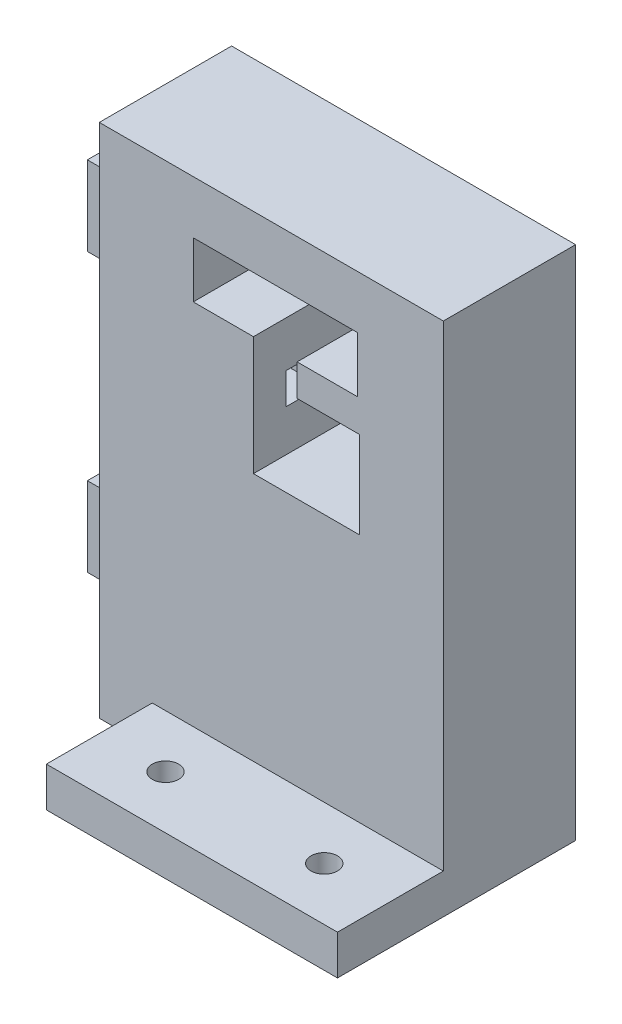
ISO-10303-21;
HEADER;
FILE_DESCRIPTION(('STEP AP214'),'2;1');
FILE_NAME('part.step','',(''),(''),'','','');
FILE_SCHEMA(('AUTOMOTIVE_DESIGN { 1 0 10303 214 1 1 1 1 }'));
ENDSEC;
DATA;
#1=APPLICATION_CONTEXT('core data for automotive mechanical design processes');
#2=APPLICATION_PROTOCOL_DEFINITION('international standard','automotive_design',2000,#1);
#3=PRODUCT_CONTEXT('',#1,'mechanical');
#4=PRODUCT('Part','Part','',(#3));
#5=PRODUCT_RELATED_PRODUCT_CATEGORY('part','',(#4));
#6=PRODUCT_DEFINITION_FORMATION('','',#4);
#7=PRODUCT_DEFINITION_CONTEXT('part definition',#1,'design');
#8=PRODUCT_DEFINITION('design','',#6,#7);
#9=PRODUCT_DEFINITION_SHAPE('','',#8);
#10=(LENGTH_UNIT() NAMED_UNIT(*) SI_UNIT(.MILLI.,.METRE.));
#11=(NAMED_UNIT(*) PLANE_ANGLE_UNIT() SI_UNIT($,.RADIAN.));
#12=(NAMED_UNIT(*) SI_UNIT($,.STERADIAN.) SOLID_ANGLE_UNIT());
#13=UNCERTAINTY_MEASURE_WITH_UNIT(LENGTH_MEASURE(1.E-05),#10,'distance_accuracy_value','');
#14=(GEOMETRIC_REPRESENTATION_CONTEXT(3) GLOBAL_UNCERTAINTY_ASSIGNED_CONTEXT((#13)) GLOBAL_UNIT_ASSIGNED_CONTEXT((#10,
#11,#12)) REPRESENTATION_CONTEXT('',''));
#15=CARTESIAN_POINT('',(0.,0.,0.));
#16=DIRECTION('',(0.,0.,1.));
#17=DIRECTION('',(1.,0.,0.));
#18=AXIS2_PLACEMENT_3D('',#15,#16,#17);
#19=CARTESIAN_POINT('',(100.,195.,-325.));
#20=DIRECTION('',(1.,0.,0.));
#21=DIRECTION('',(0.,0.,-1.));
#22=AXIS2_PLACEMENT_3D('',#19,#20,#21);
#23=PLANE('',#22);
#24=DIRECTION('',(0.,0.,1.));
#25=VECTOR('',#24,1.);
#26=CARTESIAN_POINT('',(100.,135.,0.));
#27=LINE('',#26,#25);
#28=CARTESIAN_POINT('',(100.,135.,-309.505907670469));
#29=VERTEX_POINT('',#28);
#30=CARTESIAN_POINT('',(100.,135.,-290.505907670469));
#31=VERTEX_POINT('',#30);
#32=EDGE_CURVE('E330',#29,#31,#27,.T.);
#33=ORIENTED_EDGE('',*,*,#32,.F.);
#34=DIRECTION('',(0.,1.,0.));
#35=VECTOR('',#34,1.);
#36=CARTESIAN_POINT('',(100.,0.,-309.505907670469));
#37=LINE('',#36,#35);
#38=CARTESIAN_POINT('',(100.,165.,-309.505907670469));
#39=VERTEX_POINT('',#38);
#40=EDGE_CURVE('E346',#29,#39,#37,.T.);
#41=ORIENTED_EDGE('',*,*,#40,.T.);
#42=DIRECTION('',(0.,0.,1.));
#43=VECTOR('',#42,1.);
#44=CARTESIAN_POINT('',(100.,165.,0.));
#45=LINE('',#44,#43);
#46=CARTESIAN_POINT('',(100.,165.,-290.505907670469));
#47=VERTEX_POINT('',#46);
#48=EDGE_CURVE('E80',#39,#47,#45,.T.);
#49=ORIENTED_EDGE('',*,*,#48,.T.);
#50=DIRECTION('',(0.,1.,0.));
#51=VECTOR('',#50,1.);
#52=CARTESIAN_POINT('',(100.,0.,-290.505907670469));
#53=LINE('',#52,#51);
#54=EDGE_CURVE('E335',#31,#47,#53,.T.);
#55=ORIENTED_EDGE('',*,*,#54,.F.);
#56=EDGE_LOOP('',(#33,#41,#49,#55));
#57=FACE_BOUND('',#56,.T.);
#58=DIRECTION('',(0.,0.,1.));
#59=VECTOR('',#58,1.);
#60=CARTESIAN_POINT('',(100.,195.,-325.));
#61=LINE('',#60,#59);
#62=CARTESIAN_POINT('',(100.,195.,-325.));
#63=VERTEX_POINT('',#62);
#64=CARTESIAN_POINT('',(100.,195.,-275.011815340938));
#65=VERTEX_POINT('',#64);
#66=EDGE_CURVE('E381',#63,#65,#61,.T.);
#67=ORIENTED_EDGE('',*,*,#66,.F.);
#68=DIRECTION('',(0.,1.,0.));
#69=VECTOR('',#68,1.);
#70=CARTESIAN_POINT('',(100.,195.,-325.));
#71=LINE('',#70,#69);
#72=CARTESIAN_POINT('',(100.,0.,-325.));
#73=VERTEX_POINT('',#72);
#74=EDGE_CURVE('E377',#73,#63,#71,.T.);
#75=ORIENTED_EDGE('',*,*,#74,.F.);
#76=DIRECTION('',(0.,0.,1.));
#77=VECTOR('',#76,1.);
#78=CARTESIAN_POINT('',(100.,0.,-325.));
#79=LINE('',#78,#77);
#80=CARTESIAN_POINT('',(100.,0.,-275.011815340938));
#81=VERTEX_POINT('',#80);
#82=EDGE_CURVE('E382',#73,#81,#79,.T.);
#83=ORIENTED_EDGE('',*,*,#82,.T.);
#84=DIRECTION('',(0.,-1.,0.));
#85=VECTOR('',#84,1.);
#86=CARTESIAN_POINT('',(100.,250.,-275.011815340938));
#87=LINE('',#86,#85);
#88=EDGE_CURVE('E385',#65,#81,#87,.T.);
#89=ORIENTED_EDGE('',*,*,#88,.F.);
#90=EDGE_LOOP('',(#67,#75,#83,#89));
#91=FACE_BOUND('',#90,.T.);
#92=DIRECTION('',(0.,0.,1.));
#93=VECTOR('',#92,1.);
#94=CARTESIAN_POINT('',(100.,30.,0.));
#95=LINE('',#94,#93);
#96=CARTESIAN_POINT('',(100.,30.,-309.505907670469));
#97=VERTEX_POINT('',#96);
#98=CARTESIAN_POINT('',(100.,30.,-290.505907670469));
#99=VERTEX_POINT('',#98);
#100=EDGE_CURVE('E327',#97,#99,#95,.T.);
#101=ORIENTED_EDGE('',*,*,#100,.F.);
#102=DIRECTION('',(0.,1.,0.));
#103=VECTOR('',#102,1.);
#104=CARTESIAN_POINT('',(100.,0.,-309.505907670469));
#105=LINE('',#104,#103);
#106=CARTESIAN_POINT('',(100.,60.,-309.505907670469));
#107=VERTEX_POINT('',#106);
#108=EDGE_CURVE('E323',#97,#107,#105,.T.);
#109=ORIENTED_EDGE('',*,*,#108,.T.);
#110=DIRECTION('',(0.,0.,1.));
#111=VECTOR('',#110,1.);
#112=CARTESIAN_POINT('',(100.,60.,0.));
#113=LINE('',#112,#111);
#114=CARTESIAN_POINT('',(100.,60.,-290.505907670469));
#115=VERTEX_POINT('',#114);
#116=EDGE_CURVE('E72',#107,#115,#113,.T.);
#117=ORIENTED_EDGE('',*,*,#116,.T.);
#118=DIRECTION('',(0.,1.,0.));
#119=VECTOR('',#118,1.);
#120=CARTESIAN_POINT('',(100.,0.,-290.505907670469));
#121=LINE('',#120,#119);
#122=EDGE_CURVE('E1366',#99,#115,#121,.T.);
#123=ORIENTED_EDGE('',*,*,#122,.F.);
#124=EDGE_LOOP('',(#101,#109,#117,#123));
#125=FACE_BOUND('',#124,.T.);
#126=ADVANCED_FACE('F56',(#57,#91,#125),#23,.F.);
#127=CARTESIAN_POINT('',(230.,250.,-275.011815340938));
#128=DIRECTION('',(0.,0.,-1.));
#129=DIRECTION('',(-1.,0.,0.));
#130=AXIS2_PLACEMENT_3D('',#127,#128,#129);
#131=PLANE('',#130);
#132=DIRECTION('',(0.,1.,0.));
#133=VECTOR('',#132,1.);
#134=CARTESIAN_POINT('',(174.75,154.,-275.011815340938));
#135=LINE('',#134,#133);
#136=CARTESIAN_POINT('',(174.75,142.02964265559,-275.011815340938));
#137=VERTEX_POINT('',#136);
#138=CARTESIAN_POINT('',(174.75,154.,-275.011815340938));
#139=VERTEX_POINT('',#138);
#140=EDGE_CURVE('E683',#137,#139,#135,.T.);
#141=ORIENTED_EDGE('',*,*,#140,.F.);
#142=DIRECTION('',(-1.,0.,0.));
#143=VECTOR('',#142,1.);
#144=CARTESIAN_POINT('',(158.25,142.02964265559,-275.011815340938));
#145=LINE('',#144,#143);
#146=CARTESIAN_POINT('',(198.25,142.02964265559,-275.011815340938));
#147=VERTEX_POINT('',#146);
#148=EDGE_CURVE('E456',#147,#137,#145,.T.);
#149=ORIENTED_EDGE('',*,*,#148,.F.);
#150=DIRECTION('',(0.,1.,0.));
#151=VECTOR('',#150,1.);
#152=CARTESIAN_POINT('',(198.25,142.02964265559,-275.011815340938));
#153=LINE('',#152,#151);
#154=CARTESIAN_POINT('',(198.25,109.17533799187,-275.011815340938));
#155=VERTEX_POINT('',#154);
#156=EDGE_CURVE('E1416',#155,#147,#153,.T.);
#157=ORIENTED_EDGE('',*,*,#156,.F.);
#158=DIRECTION('',(1.,0.,0.));
#159=VECTOR('',#158,1.);
#160=CARTESIAN_POINT('',(198.25,109.17533799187,-275.011815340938));
#161=LINE('',#160,#159);
#162=CARTESIAN_POINT('',(158.25,109.17533799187,-275.011815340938));
#163=VERTEX_POINT('',#162);
#164=EDGE_CURVE('E1412',#163,#155,#161,.T.);
#165=ORIENTED_EDGE('',*,*,#164,.F.);
#166=DIRECTION('',(0.,-1.,0.));
#167=VECTOR('',#166,1.);
#168=CARTESIAN_POINT('',(158.25,154.,-275.011815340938));
#169=LINE('',#168,#167);
#170=CARTESIAN_POINT('',(158.25,154.,-275.011815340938));
#171=VERTEX_POINT('',#170);
#172=EDGE_CURVE('E672',#171,#163,#169,.T.);
#173=ORIENTED_EDGE('',*,*,#172,.F.);
#174=DIRECTION('',(-1.,0.,0.));
#175=VECTOR('',#174,1.);
#176=CARTESIAN_POINT('',(230.,154.,-275.011815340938));
#177=LINE('',#176,#175);
#178=CARTESIAN_POINT('',(135.5,154.,-275.011815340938));
#179=VERTEX_POINT('',#178);
#180=EDGE_CURVE('E599',#171,#179,#177,.T.);
#181=ORIENTED_EDGE('',*,*,#180,.T.);
#182=DIRECTION('',(0.,1.,0.));
#183=VECTOR('',#182,1.);
#184=CARTESIAN_POINT('',(135.5,250.,-275.011815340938));
#185=LINE('',#184,#183);
#186=CARTESIAN_POINT('',(135.5,175.,-275.011815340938));
#187=VERTEX_POINT('',#186);
#188=EDGE_CURVE('E604',#179,#187,#185,.T.);
#189=ORIENTED_EDGE('',*,*,#188,.T.);
#190=DIRECTION('',(1.,0.,0.));
#191=VECTOR('',#190,1.);
#192=CARTESIAN_POINT('',(230.,175.,-275.011815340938));
#193=LINE('',#192,#191);
#194=CARTESIAN_POINT('',(197.5,175.,-275.011815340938));
#195=VERTEX_POINT('',#194);
#196=EDGE_CURVE('E585',#187,#195,#193,.T.);
#197=ORIENTED_EDGE('',*,*,#196,.T.);
#198=DIRECTION('',(0.,-1.,0.));
#199=VECTOR('',#198,1.);
#200=CARTESIAN_POINT('',(197.5,250.,-275.011815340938));
#201=LINE('',#200,#199);
#202=CARTESIAN_POINT('',(197.5,154.,-275.011815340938));
#203=VERTEX_POINT('',#202);
#204=EDGE_CURVE('E595',#195,#203,#201,.T.);
#205=ORIENTED_EDGE('',*,*,#204,.T.);
#206=EDGE_CURVE('E600',#203,#139,#177,.T.);
#207=ORIENTED_EDGE('',*,*,#206,.T.);
#208=EDGE_LOOP('',(#141,#149,#157,#165,#173,#181,#189,#197,#205,#207));
#209=FACE_BOUND('',#208,.T.);
#210=DIRECTION('',(1.,0.,0.));
#211=VECTOR('',#210,1.);
#212=CARTESIAN_POINT('',(230.,195.,-275.011815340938));
#213=LINE('',#212,#211);
#214=CARTESIAN_POINT('',(230.,195.,-275.011815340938));
#215=VERTEX_POINT('',#214);
#216=EDGE_CURVE('E700',#65,#215,#213,.T.);
#217=ORIENTED_EDGE('',*,*,#216,.F.);
#218=ORIENTED_EDGE('',*,*,#88,.T.);
#219=DIRECTION('',(-1.,0.,0.));
#220=VECTOR('',#219,1.);
#221=CARTESIAN_POINT('',(230.,0.,-275.011815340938));
#222=LINE('',#221,#220);
#223=CARTESIAN_POINT('',(120.,0.,-275.011815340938));
#224=VERTEX_POINT('',#223);
#225=EDGE_CURVE('E575',#224,#81,#222,.T.);
#226=ORIENTED_EDGE('',*,*,#225,.F.);
#227=DIRECTION('',(0.,-1.,0.));
#228=VECTOR('',#227,1.);
#229=CARTESIAN_POINT('',(120.,0.,-275.011815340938));
#230=LINE('',#229,#228);
#231=CARTESIAN_POINT('',(120.,15.,-275.011815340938));
#232=VERTEX_POINT('',#231);
#233=EDGE_CURVE('E414',#232,#224,#230,.T.);
#234=ORIENTED_EDGE('',*,*,#233,.F.);
#235=DIRECTION('',(-1.,0.,0.));
#236=VECTOR('',#235,1.);
#237=CARTESIAN_POINT('',(0.,15.,-275.011815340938));
#238=LINE('',#237,#236);
#239=CARTESIAN_POINT('',(230.,15.,-275.011815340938));
#240=VERTEX_POINT('',#239);
#241=EDGE_CURVE('E397',#240,#232,#238,.T.);
#242=ORIENTED_EDGE('',*,*,#241,.F.);
#243=DIRECTION('',(0.,-1.,0.));
#244=VECTOR('',#243,1.);
#245=CARTESIAN_POINT('',(230.,250.,-275.011815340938));
#246=LINE('',#245,#244);
#247=EDGE_CURVE('E588',#215,#240,#246,.T.);
#248=ORIENTED_EDGE('',*,*,#247,.F.);
#249=EDGE_LOOP('',(#217,#218,#226,#234,#242,#248));
#250=FACE_BOUND('',#249,.T.);
#251=ADVANCED_FACE('F522',(#209,#250),#131,.F.);
#252=CARTESIAN_POINT('',(197.5,154.,1.66533453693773E-13));
#253=DIRECTION('',(0.,-1.,0.));
#254=DIRECTION('',(0.,0.,-1.));
#255=AXIS2_PLACEMENT_3D('',#252,#253,#254);
#256=PLANE('',#255);
#257=DIRECTION('',(-1.,0.,0.));
#258=VECTOR('',#257,1.);
#259=CARTESIAN_POINT('',(197.5,154.,-325.));
#260=LINE('',#259,#258);
#261=CARTESIAN_POINT('',(197.5,154.,-325.));
#262=VERTEX_POINT('',#261);
#263=CARTESIAN_POINT('',(174.75,154.,-325.));
#264=VERTEX_POINT('',#263);
#265=EDGE_CURVE('E722',#262,#264,#260,.T.);
#266=ORIENTED_EDGE('',*,*,#265,.T.);
#267=DIRECTION('',(0.,0.,1.));
#268=VECTOR('',#267,1.);
#269=CARTESIAN_POINT('',(174.75,154.,-325.011815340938));
#270=LINE('',#269,#268);
#271=EDGE_CURVE('E687',#264,#139,#270,.T.);
#272=ORIENTED_EDGE('',*,*,#271,.T.);
#273=ORIENTED_EDGE('',*,*,#206,.F.);
#274=DIRECTION('',(0.,0.,-1.));
#275=VECTOR('',#274,1.);
#276=CARTESIAN_POINT('',(197.5,154.,1.66533453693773E-13));
#277=LINE('',#276,#275);
#278=EDGE_CURVE('E732',#203,#262,#277,.T.);
#279=ORIENTED_EDGE('',*,*,#278,.T.);
#280=EDGE_LOOP('',(#266,#272,#273,#279));
#281=FACE_BOUND('',#280,.T.);
#282=ADVANCED_FACE('F528',(#281),#256,.F.);
#283=CARTESIAN_POINT('',(0.,0.,0.));
#284=DIRECTION('',(0.,-1.,0.));
#285=DIRECTION('',(0.,0.,-1.));
#286=AXIS2_PLACEMENT_3D('',#283,#284,#285);
#287=PLANE('',#286);
#288=ORIENTED_EDGE('',*,*,#82,.F.);
#289=DIRECTION('',(-1.,0.,0.));
#290=VECTOR('',#289,1.);
#291=CARTESIAN_POINT('',(101.037708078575,0.,-325.));
#292=LINE('',#291,#290);
#293=CARTESIAN_POINT('',(230.,0.,-325.));
#294=VERTEX_POINT('',#293);
#295=EDGE_CURVE('E579',#294,#73,#292,.T.);
#296=ORIENTED_EDGE('',*,*,#295,.F.);
#297=DIRECTION('',(0.,0.,-1.));
#298=VECTOR('',#297,1.);
#299=CARTESIAN_POINT('',(230.,0.,-275.011815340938));
#300=LINE('',#299,#298);
#301=CARTESIAN_POINT('',(230.,0.,-235.011815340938));
#302=VERTEX_POINT('',#301);
#303=EDGE_CURVE('E580',#302,#294,#300,.T.);
#304=ORIENTED_EDGE('',*,*,#303,.F.);
#305=DIRECTION('',(1.,0.,0.));
#306=VECTOR('',#305,1.);
#307=CARTESIAN_POINT('',(0.,0.,-235.011815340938));
#308=LINE('',#307,#306);
#309=CARTESIAN_POINT('',(120.,0.,-235.011815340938));
#310=VERTEX_POINT('',#309);
#311=EDGE_CURVE('E420',#310,#302,#308,.T.);
#312=ORIENTED_EDGE('',*,*,#311,.F.);
#313=DIRECTION('',(0.,0.,-1.));
#314=VECTOR('',#313,1.);
#315=CARTESIAN_POINT('',(120.,0.,-235.011815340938));
#316=LINE('',#315,#314);
#317=EDGE_CURVE('E424',#310,#224,#316,.T.);
#318=ORIENTED_EDGE('',*,*,#317,.T.);
#319=ORIENTED_EDGE('',*,*,#225,.T.);
#320=EDGE_LOOP('',(#288,#296,#304,#312,#318,#319));
#321=FACE_BOUND('',#320,.T.);
#322=CARTESIAN_POINT('',(145.,0.,-255.011815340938));
#323=DIRECTION('',(0.,1.,0.));
#324=DIRECTION('',(-1.,0.,0.));
#325=AXIS2_PLACEMENT_3D('',#322,#323,#324);
#326=CIRCLE('',#325,5.00000000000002);
#327=CARTESIAN_POINT('',(140.,0.,-255.011815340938));
#328=VERTEX_POINT('',#327);
#329=EDGE_CURVE('E393',#328,#328,#326,.T.);
#330=ORIENTED_EDGE('',*,*,#329,.T.);
#331=EDGE_LOOP('',(#330));
#332=FACE_BOUND('',#331,.T.);
#333=CARTESIAN_POINT('',(205.,0.,-255.011815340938));
#334=DIRECTION('',(0.,1.,0.));
#335=DIRECTION('',(-1.,0.,0.));
#336=AXIS2_PLACEMENT_3D('',#333,#334,#335);
#337=CIRCLE('',#336,5.00000000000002);
#338=CARTESIAN_POINT('',(200.,0.,-255.011815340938));
#339=VERTEX_POINT('',#338);
#340=EDGE_CURVE('E392',#339,#339,#337,.T.);
#341=ORIENTED_EDGE('',*,*,#340,.T.);
#342=EDGE_LOOP('',(#341));
#343=FACE_BOUND('',#342,.T.);
#344=ADVANCED_FACE('F58',(#321,#332,#343),#287,.T.);
#345=CARTESIAN_POINT('',(230.,0.,0.));
#346=DIRECTION('',(1.,0.,0.));
#347=DIRECTION('',(0.,0.,-1.));
#348=AXIS2_PLACEMENT_3D('',#345,#346,#347);
#349=PLANE('',#348);
#350=DIRECTION('',(0.,0.,-1.));
#351=VECTOR('',#350,1.);
#352=CARTESIAN_POINT('',(230.,195.,-325.));
#353=LINE('',#352,#351);
#354=CARTESIAN_POINT('',(230.,195.,-325.));
#355=VERTEX_POINT('',#354);
#356=EDGE_CURVE('E703',#215,#355,#353,.T.);
#357=ORIENTED_EDGE('',*,*,#356,.F.);
#358=ORIENTED_EDGE('',*,*,#247,.T.);
#359=DIRECTION('',(0.,0.,-1.));
#360=VECTOR('',#359,1.);
#361=CARTESIAN_POINT('',(230.,15.,-235.011815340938));
#362=LINE('',#361,#360);
#363=CARTESIAN_POINT('',(230.,15.,-235.011815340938));
#364=VERTEX_POINT('',#363);
#365=EDGE_CURVE('E436',#364,#240,#362,.T.);
#366=ORIENTED_EDGE('',*,*,#365,.F.);
#367=DIRECTION('',(0.,1.,0.));
#368=VECTOR('',#367,1.);
#369=CARTESIAN_POINT('',(230.,0.,-235.011815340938));
#370=LINE('',#369,#368);
#371=EDGE_CURVE('E409',#302,#364,#370,.T.);
#372=ORIENTED_EDGE('',*,*,#371,.F.);
#373=ORIENTED_EDGE('',*,*,#303,.T.);
#374=DIRECTION('',(0.,1.,0.));
#375=VECTOR('',#374,1.);
#376=CARTESIAN_POINT('',(230.,0.,-325.));
#377=LINE('',#376,#375);
#378=EDGE_CURVE('E731',#294,#355,#377,.T.);
#379=ORIENTED_EDGE('',*,*,#378,.T.);
#380=EDGE_LOOP('',(#357,#358,#366,#372,#373,#379));
#381=FACE_BOUND('',#380,.T.);
#382=ADVANCED_FACE('F746',(#381),#349,.T.);
#383=CARTESIAN_POINT('',(197.5,175.,1.66533453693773E-13));
#384=DIRECTION('',(1.,0.,0.));
#385=DIRECTION('',(0.,0.,-1.));
#386=AXIS2_PLACEMENT_3D('',#383,#384,#385);
#387=PLANE('',#386);
#388=DIRECTION('',(0.,0.,-1.));
#389=VECTOR('',#388,1.);
#390=CARTESIAN_POINT('',(197.5,175.,1.66533453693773E-13));
#391=LINE('',#390,#389);
#392=CARTESIAN_POINT('',(197.5,175.,-325.));
#393=VERTEX_POINT('',#392);
#394=EDGE_CURVE('E735',#195,#393,#391,.T.);
#395=ORIENTED_EDGE('',*,*,#394,.T.);
#396=DIRECTION('',(0.,-1.,0.));
#397=VECTOR('',#396,1.);
#398=CARTESIAN_POINT('',(197.5,175.,-325.));
#399=LINE('',#398,#397);
#400=EDGE_CURVE('E717',#393,#262,#399,.T.);
#401=ORIENTED_EDGE('',*,*,#400,.T.);
#402=ORIENTED_EDGE('',*,*,#278,.F.);
#403=ORIENTED_EDGE('',*,*,#204,.F.);
#404=EDGE_LOOP('',(#395,#401,#402,#403));
#405=FACE_BOUND('',#404,.T.);
#406=ADVANCED_FACE('F768',(#405),#387,.F.);
#407=CARTESIAN_POINT('',(166.5,175.,1.66533453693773E-13));
#408=DIRECTION('',(0.,1.,0.));
#409=DIRECTION('',(0.,0.,1.));
#410=AXIS2_PLACEMENT_3D('',#407,#408,#409);
#411=PLANE('',#410);
#412=DIRECTION('',(0.,0.,-1.));
#413=VECTOR('',#412,1.);
#414=CARTESIAN_POINT('',(135.5,175.,1.11022302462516E-13));
#415=LINE('',#414,#413);
#416=CARTESIAN_POINT('',(135.5,175.,-325.));
#417=VERTEX_POINT('',#416);
#418=EDGE_CURVE('E726',#187,#417,#415,.T.);
#419=ORIENTED_EDGE('',*,*,#418,.T.);
#420=DIRECTION('',(1.,0.,0.));
#421=VECTOR('',#420,1.);
#422=CARTESIAN_POINT('',(166.5,175.,-325.));
#423=LINE('',#422,#421);
#424=EDGE_CURVE('E713',#417,#393,#423,.T.);
#425=ORIENTED_EDGE('',*,*,#424,.T.);
#426=ORIENTED_EDGE('',*,*,#394,.F.);
#427=ORIENTED_EDGE('',*,*,#196,.F.);
#428=EDGE_LOOP('',(#419,#425,#426,#427));
#429=FACE_BOUND('',#428,.T.);
#430=ADVANCED_FACE('F784',(#429),#411,.F.);
#431=CARTESIAN_POINT('',(135.5,154.,1.11022302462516E-13));
#432=DIRECTION('',(-1.,0.,0.));
#433=DIRECTION('',(0.,0.,1.));
#434=AXIS2_PLACEMENT_3D('',#431,#432,#433);
#435=PLANE('',#434);
#436=DIRECTION('',(0.,0.,-1.));
#437=VECTOR('',#436,1.);
#438=CARTESIAN_POINT('',(135.5,154.,1.11022302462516E-13));
#439=LINE('',#438,#437);
#440=CARTESIAN_POINT('',(135.5,154.,-325.));
#441=VERTEX_POINT('',#440);
#442=EDGE_CURVE('E727',#179,#441,#439,.T.);
#443=ORIENTED_EDGE('',*,*,#442,.T.);
#444=DIRECTION('',(0.,1.,0.));
#445=VECTOR('',#444,1.);
#446=CARTESIAN_POINT('',(135.5,154.,-325.));
#447=LINE('',#446,#445);
#448=EDGE_CURVE('E710',#441,#417,#447,.T.);
#449=ORIENTED_EDGE('',*,*,#448,.T.);
#450=ORIENTED_EDGE('',*,*,#418,.F.);
#451=ORIENTED_EDGE('',*,*,#188,.F.);
#452=EDGE_LOOP('',(#443,#449,#450,#451));
#453=FACE_BOUND('',#452,.T.);
#454=ADVANCED_FACE('F778',(#453),#435,.F.);
#455=ORIENTED_EDGE('',*,*,#180,.F.);
#456=DIRECTION('',(0.,0.,1.));
#457=VECTOR('',#456,1.);
#458=CARTESIAN_POINT('',(158.25,154.,-325.011815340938));
#459=LINE('',#458,#457);
#460=CARTESIAN_POINT('',(158.25,154.,-325.));
#461=VERTEX_POINT('',#460);
#462=EDGE_CURVE('E686',#461,#171,#459,.T.);
#463=ORIENTED_EDGE('',*,*,#462,.F.);
#464=EDGE_CURVE('E721',#461,#441,#260,.T.);
#465=ORIENTED_EDGE('',*,*,#464,.T.);
#466=ORIENTED_EDGE('',*,*,#442,.F.);
#467=EDGE_LOOP('',(#455,#463,#465,#466));
#468=FACE_BOUND('',#467,.T.);
#469=ADVANCED_FACE('F772',(#468),#256,.F.);
#470=CARTESIAN_POINT('',(101.037708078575,71.6208477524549,-325.));
#471=DIRECTION('',(0.,0.,-1.));
#472=DIRECTION('',(-1.,0.,0.));
#473=AXIS2_PLACEMENT_3D('',#470,#471,#472);
#474=PLANE('',#473);
#475=ORIENTED_EDGE('',*,*,#74,.T.);
#476=DIRECTION('',(-1.,0.,0.));
#477=VECTOR('',#476,1.);
#478=CARTESIAN_POINT('',(30.,195.,-325.));
#479=LINE('',#478,#477);
#480=EDGE_CURVE('E706',#355,#63,#479,.T.);
#481=ORIENTED_EDGE('',*,*,#480,.F.);
#482=ORIENTED_EDGE('',*,*,#378,.F.);
#483=ORIENTED_EDGE('',*,*,#295,.T.);
#484=EDGE_LOOP('',(#475,#481,#482,#483));
#485=FACE_BOUND('',#484,.T.);
#486=CARTESIAN_POINT('',(131.61635674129,129.990231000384,-325.));
#487=DIRECTION('',(0.,0.,-1.));
#488=DIRECTION('',(-1.,0.,0.));
#489=AXIS2_PLACEMENT_3D('',#486,#487,#488);
#490=CIRCLE('',#489,3.49999999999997);
#491=CARTESIAN_POINT('',(128.11635674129,129.990231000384,-325.));
#492=VERTEX_POINT('',#491);
#493=EDGE_CURVE('E439',#492,#492,#490,.T.);
#494=ORIENTED_EDGE('',*,*,#493,.F.);
#495=EDGE_LOOP('',(#494));
#496=FACE_BOUND('',#495,.T.);
#497=DIRECTION('',(1.,0.,0.));
#498=VECTOR('',#497,1.);
#499=CARTESIAN_POINT('',(101.037708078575,142.02964265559,-325.));
#500=LINE('',#499,#498);
#501=CARTESIAN_POINT('',(174.75,142.02964265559,-325.));
#502=VERTEX_POINT('',#501);
#503=CARTESIAN_POINT('',(198.25,142.02964265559,-325.));
#504=VERTEX_POINT('',#503);
#505=EDGE_CURVE('E813',#502,#504,#500,.T.);
#506=ORIENTED_EDGE('',*,*,#505,.F.);
#507=DIRECTION('',(0.,-1.,0.));
#508=VECTOR('',#507,1.);
#509=CARTESIAN_POINT('',(174.75,71.620847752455,-325.));
#510=LINE('',#509,#508);
#511=EDGE_CURVE('E696',#264,#502,#510,.T.);
#512=ORIENTED_EDGE('',*,*,#511,.F.);
#513=ORIENTED_EDGE('',*,*,#265,.F.);
#514=ORIENTED_EDGE('',*,*,#400,.F.);
#515=ORIENTED_EDGE('',*,*,#424,.F.);
#516=ORIENTED_EDGE('',*,*,#448,.F.);
#517=ORIENTED_EDGE('',*,*,#464,.F.);
#518=DIRECTION('',(0.,1.,0.));
#519=VECTOR('',#518,1.);
#520=CARTESIAN_POINT('',(158.25,71.620847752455,-325.));
#521=LINE('',#520,#519);
#522=CARTESIAN_POINT('',(158.25,109.17533799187,-325.));
#523=VERTEX_POINT('',#522);
#524=EDGE_CURVE('E691',#523,#461,#521,.T.);
#525=ORIENTED_EDGE('',*,*,#524,.F.);
#526=DIRECTION('',(-1.,0.,0.));
#527=VECTOR('',#526,1.);
#528=CARTESIAN_POINT('',(101.037708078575,109.17533799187,-325.));
#529=LINE('',#528,#527);
#530=CARTESIAN_POINT('',(198.25,109.17533799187,-325.));
#531=VERTEX_POINT('',#530);
#532=EDGE_CURVE('E818',#531,#523,#529,.T.);
#533=ORIENTED_EDGE('',*,*,#532,.F.);
#534=DIRECTION('',(0.,-1.,0.));
#535=VECTOR('',#534,1.);
#536=CARTESIAN_POINT('',(198.25,71.6208477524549,-325.));
#537=LINE('',#536,#535);
#538=EDGE_CURVE('E815',#504,#531,#537,.T.);
#539=ORIENTED_EDGE('',*,*,#538,.F.);
#540=EDGE_LOOP('',(#506,#512,#513,#514,#515,#516,#517,#525,#533,#539));
#541=FACE_BOUND('',#540,.T.);
#542=ADVANCED_FACE('F753',(#485,#496,#541),#474,.T.);
#543=CARTESIAN_POINT('',(0.,195.,0.));
#544=DIRECTION('',(0.,-1.,0.));
#545=DIRECTION('',(0.,0.,-1.));
#546=AXIS2_PLACEMENT_3D('',#543,#544,#545);
#547=PLANE('',#546);
#548=ORIENTED_EDGE('',*,*,#480,.T.);
#549=ORIENTED_EDGE('',*,*,#66,.T.);
#550=ORIENTED_EDGE('',*,*,#216,.T.);
#551=ORIENTED_EDGE('',*,*,#356,.T.);
#552=EDGE_LOOP('',(#548,#549,#550,#551));
#553=FACE_BOUND('',#552,.T.);
#554=ADVANCED_FACE('F749',(#553),#547,.F.);
#555=CARTESIAN_POINT('',(174.75,154.,-325.011815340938));
#556=DIRECTION('',(1.,0.,0.));
#557=DIRECTION('',(0.,1.,0.));
#558=AXIS2_PLACEMENT_3D('',#555,#556,#557);
#559=PLANE('',#558);
#560=ORIENTED_EDGE('',*,*,#511,.T.);
#561=DIRECTION('',(0.,0.,1.));
#562=VECTOR('',#561,1.);
#563=CARTESIAN_POINT('',(174.75,142.02964265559,-325.011815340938));
#564=LINE('',#563,#562);
#565=EDGE_CURVE('E819',#502,#137,#564,.T.);
#566=ORIENTED_EDGE('',*,*,#565,.T.);
#567=ORIENTED_EDGE('',*,*,#140,.T.);
#568=ORIENTED_EDGE('',*,*,#271,.F.);
#569=EDGE_LOOP('',(#560,#566,#567,#568));
#570=FACE_BOUND('',#569,.T.);
#571=ADVANCED_FACE('F810',(#570),#559,.F.);
#572=CARTESIAN_POINT('',(158.25,154.,-325.011815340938));
#573=DIRECTION('',(-1.,0.,0.));
#574=DIRECTION('',(0.,-1.,0.));
#575=AXIS2_PLACEMENT_3D('',#572,#573,#574);
#576=PLANE('',#575);
#577=ORIENTED_EDGE('',*,*,#172,.T.);
#578=DIRECTION('',(0.,0.,1.));
#579=VECTOR('',#578,1.);
#580=CARTESIAN_POINT('',(158.25,109.17533799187,-325.011815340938));
#581=LINE('',#580,#579);
#582=EDGE_CURVE('E1409',#523,#163,#581,.T.);
#583=ORIENTED_EDGE('',*,*,#582,.F.);
#584=ORIENTED_EDGE('',*,*,#524,.T.);
#585=ORIENTED_EDGE('',*,*,#462,.T.);
#586=EDGE_LOOP('',(#577,#583,#584,#585));
#587=FACE_BOUND('',#586,.T.);
#588=DIRECTION('',(0.,0.,1.));
#589=VECTOR('',#588,1.);
#590=CARTESIAN_POINT('',(158.25,136.72325264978,-287.320111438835));
#591=LINE('',#590,#589);
#592=CARTESIAN_POINT('',(158.25,136.72325264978,-300.820111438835));
#593=VERTEX_POINT('',#592);
#594=CARTESIAN_POINT('',(158.25,136.72325264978,-287.320111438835));
#595=VERTEX_POINT('',#594);
#596=EDGE_CURVE('E837',#593,#595,#591,.T.);
#597=ORIENTED_EDGE('',*,*,#596,.F.);
#598=DIRECTION('',(0.,1.,0.));
#599=VECTOR('',#598,1.);
#600=CARTESIAN_POINT('',(158.25,136.72325264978,-300.820111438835));
#601=LINE('',#600,#599);
#602=CARTESIAN_POINT('',(158.25,132.848593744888,-300.820111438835));
#603=VERTEX_POINT('',#602);
#604=EDGE_CURVE('E871',#603,#593,#601,.T.);
#605=ORIENTED_EDGE('',*,*,#604,.F.);
#606=CARTESIAN_POINT('',(158.25,125.100374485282,-298.75115225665));
#607=CARTESIAN_POINT('',(158.25,129.957776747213,-304.296229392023));
#608=CARTESIAN_POINT('',(158.25,135.600374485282,-298.75115225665));
#609=B_SPLINE_CURVE_WITH_KNOTS('',2,(#606,#607,#608),.UNSPECIFIED.,.F.,.F.,(3,3),(0.,1.),.UNSPECIFIED.);
#610=CARTESIAN_POINT('',(158.25,127.559185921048,-300.820111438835));
#611=VERTEX_POINT('',#610);
#612=EDGE_CURVE('E658',#611,#603,#609,.T.);
#613=ORIENTED_EDGE('',*,*,#612,.F.);
#614=CARTESIAN_POINT('',(158.25,124.92325264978,-300.820111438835));
#615=VERTEX_POINT('',#614);
#616=EDGE_CURVE('E846',#615,#611,#601,.T.);
#617=ORIENTED_EDGE('',*,*,#616,.F.);
#618=DIRECTION('',(0.,0.,-1.));
#619=VECTOR('',#618,1.);
#620=CARTESIAN_POINT('',(158.25,124.92325264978,-287.320111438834));
#621=LINE('',#620,#619);
#622=CARTESIAN_POINT('',(158.25,124.92325264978,-287.320111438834));
#623=VERTEX_POINT('',#622);
#624=EDGE_CURVE('E867',#623,#615,#621,.T.);
#625=ORIENTED_EDGE('',*,*,#624,.F.);
#626=DIRECTION('',(0.,-1.,0.));
#627=VECTOR('',#626,1.);
#628=CARTESIAN_POINT('',(158.25,124.92325264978,-287.320111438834));
#629=LINE('',#628,#627);
#630=EDGE_CURVE('E863',#595,#623,#629,.T.);
#631=ORIENTED_EDGE('',*,*,#630,.F.);
#632=EDGE_LOOP('',(#597,#605,#613,#617,#625,#631));
#633=FACE_BOUND('',#632,.T.);
#634=ADVANCED_FACE('F517',(#587,#633),#576,.F.);
#635=CARTESIAN_POINT('',(129.25,135.600374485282,-291.25115225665));
#636=CARTESIAN_POINT('',(129.25,129.957776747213,-285.706075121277));
#637=CARTESIAN_POINT('',(129.25,125.100374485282,-291.25115225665));
#638=B_SPLINE_CURVE_WITH_KNOTS('',2,(#635,#636,#637),.UNSPECIFIED.,.F.,.F.,(3,3),(0.,1.),.UNSPECIFIED.);
#639=DIRECTION('',(1.,0.,0.));
#640=VECTOR('',#639,1.);
#641=SURFACE_OF_LINEAR_EXTRUSION('',#638,#640);
#642=CARTESIAN_POINT('',(144.75,135.600374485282,-291.25115225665));
#643=CARTESIAN_POINT('',(144.75,129.957776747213,-285.706075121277));
#644=CARTESIAN_POINT('',(144.75,125.100374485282,-291.25115225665));
#645=B_SPLINE_CURVE_WITH_KNOTS('',2,(#642,#643,#644),.UNSPECIFIED.,.F.,.F.,(3,3),(0.,1.),.UNSPECIFIED.);
#646=CARTESIAN_POINT('',(144.75,135.600374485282,-291.25115225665));
#647=VERTEX_POINT('',#646);
#648=CARTESIAN_POINT('',(144.75,130.154075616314,-288.478613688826));
#649=VERTEX_POINT('',#648);
#650=EDGE_CURVE('E664',#647,#649,#645,.T.);
#651=ORIENTED_EDGE('',*,*,#650,.T.);
#652=CARTESIAN_POINT('',(144.75,67942.2814258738,-997991.117730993));
#653=CARTESIAN_POINT('',(144.75,-64678.6411556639,997609.231159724));
#654=CARTESIAN_POINT('',(144.75,61934.4401735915,-998381.297183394));
#655=B_SPLINE_CURVE_WITH_KNOTS('',2,(#652,#653,#654),.UNSPECIFIED.,.F.,.F.,(3,3),(0.,1.),.UNSPECIFIED.);
#656=CARTESIAN_POINT('',(144.75,130.153939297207,-288.478613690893));
#657=VERTEX_POINT('',#656);
#658=EDGE_CURVE('E831',#649,#657,#655,.T.);
#659=ORIENTED_EDGE('',*,*,#658,.T.);
#660=CARTESIAN_POINT('',(144.75,125.100374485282,-291.25115225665));
#661=VERTEX_POINT('',#660);
#662=EDGE_CURVE('E892',#657,#661,#645,.T.);
#663=ORIENTED_EDGE('',*,*,#662,.T.);
#664=DIRECTION('',(1.,0.,0.));
#665=VECTOR('',#664,1.);
#666=CARTESIAN_POINT('',(129.25,125.100374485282,-291.25115225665));
#667=LINE('',#666,#665);
#668=CARTESIAN_POINT('',(129.25,125.100374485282,-291.25115225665));
#669=VERTEX_POINT('',#668);
#670=EDGE_CURVE('E657',#669,#661,#667,.T.);
#671=ORIENTED_EDGE('',*,*,#670,.F.);
#672=CARTESIAN_POINT('',(129.25,135.600374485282,-291.25115225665));
#673=VERTEX_POINT('',#672);
#674=EDGE_CURVE('E645',#673,#669,#638,.T.);
#675=ORIENTED_EDGE('',*,*,#674,.F.);
#676=DIRECTION('',(1.,0.,0.));
#677=VECTOR('',#676,1.);
#678=CARTESIAN_POINT('',(129.25,135.600374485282,-291.25115225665));
#679=LINE('',#678,#677);
#680=EDGE_CURVE('E665',#673,#647,#679,.T.);
#681=ORIENTED_EDGE('',*,*,#680,.T.);
#682=EDGE_LOOP('',(#651,#659,#663,#671,#675,#681));
#683=FACE_BOUND('',#682,.T.);
#684=ADVANCED_FACE('F510',(#683),#641,.F.);
#685=CARTESIAN_POINT('',(129.25,135.600374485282,-298.75115225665));
#686=DIRECTION('',(0.,1.,0.));
#687=DIRECTION('',(0.,0.,1.));
#688=AXIS2_PLACEMENT_3D('',#685,#686,#687);
#689=PLANE('',#688);
#690=DIRECTION('',(1.,0.,0.));
#691=VECTOR('',#690,1.);
#692=CARTESIAN_POINT('',(129.25,135.600374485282,-298.75115225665));
#693=LINE('',#692,#691);
#694=CARTESIAN_POINT('',(129.25,135.600374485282,-298.75115225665));
#695=VERTEX_POINT('',#694);
#696=CARTESIAN_POINT('',(144.75,135.600374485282,-298.75115225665));
#697=VERTEX_POINT('',#696);
#698=EDGE_CURVE('E637',#695,#697,#693,.T.);
#699=ORIENTED_EDGE('',*,*,#698,.T.);
#700=DIRECTION('',(0.,0.,1.));
#701=VECTOR('',#700,1.);
#702=CARTESIAN_POINT('',(144.75,135.600374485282,-298.75115225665));
#703=LINE('',#702,#701);
#704=EDGE_CURVE('E902',#697,#647,#703,.T.);
#705=ORIENTED_EDGE('',*,*,#704,.T.);
#706=ORIENTED_EDGE('',*,*,#680,.F.);
#707=DIRECTION('',(0.,0.,1.));
#708=VECTOR('',#707,1.);
#709=CARTESIAN_POINT('',(129.25,135.600374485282,-298.75115225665));
#710=LINE('',#709,#708);
#711=EDGE_CURVE('E644',#695,#673,#710,.T.);
#712=ORIENTED_EDGE('',*,*,#711,.F.);
#713=EDGE_LOOP('',(#699,#705,#706,#712));
#714=FACE_BOUND('',#713,.T.);
#715=ADVANCED_FACE('F508',(#714),#689,.F.);
#716=CARTESIAN_POINT('',(129.25,125.100374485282,-298.75115225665));
#717=CARTESIAN_POINT('',(129.25,129.957776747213,-304.296229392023));
#718=CARTESIAN_POINT('',(129.25,135.600374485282,-298.75115225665));
#719=B_SPLINE_CURVE_WITH_KNOTS('',2,(#716,#717,#718),.UNSPECIFIED.,.F.,.F.,(3,3),(0.,1.),.UNSPECIFIED.);
#720=DIRECTION('',(1.,0.,0.));
#721=VECTOR('',#720,1.);
#722=SURFACE_OF_LINEAR_EXTRUSION('',#719,#721);
#723=CARTESIAN_POINT('',(129.25,132.569059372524,-300.956382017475));
#724=VERTEX_POINT('',#723);
#725=EDGE_CURVE('E635',#724,#695,#719,.T.);
#726=ORIENTED_EDGE('',*,*,#725,.F.);
#727=CARTESIAN_POINT('',(129.25,132.569059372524,-300.956382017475));
#728=CARTESIAN_POINT('',(129.319374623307,132.63271473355,-300.926960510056));
#729=CARTESIAN_POINT('',(129.391363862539,132.6936193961,-300.897711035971));
#730=CARTESIAN_POINT('',(129.540330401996,132.809634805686,-300.8402561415));
#731=CARTESIAN_POINT('',(129.617310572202,132.864742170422,-300.812051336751));
#732=CARTESIAN_POINT('',(129.776463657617,132.969141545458,-300.757240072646));
#733=CARTESIAN_POINT('',(129.858667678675,133.018392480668,-300.730645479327));
#734=CARTESIAN_POINT('',(130.027441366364,133.110259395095,-300.679987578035));
#735=CARTESIAN_POINT('',(130.114010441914,133.152876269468,-300.655923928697));
#736=CARTESIAN_POINT('',(130.291511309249,133.231255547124,-300.61092174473));
#737=CARTESIAN_POINT('',(130.382461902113,133.266984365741,-300.589998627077));
#738=CARTESIAN_POINT('',(130.567728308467,133.330885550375,-300.552097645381));
#739=CARTESIAN_POINT('',(130.66204217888,133.359062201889,-300.535117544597));
#740=CARTESIAN_POINT('',(130.853096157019,133.407410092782,-300.505721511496));
#741=CARTESIAN_POINT('',(130.949828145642,133.427605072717,-300.493292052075));
#742=CARTESIAN_POINT('',(131.145148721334,133.459777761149,-300.473388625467));
#743=CARTESIAN_POINT('',(131.243737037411,133.471756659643,-300.465913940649));
#744=CARTESIAN_POINT('',(131.431374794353,133.486469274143,-300.45671887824));
#745=CARTESIAN_POINT('',(131.520333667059,133.490044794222,-300.454474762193));
#746=CARTESIAN_POINT('',(131.698268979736,133.490402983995,-300.454250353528));
#747=CARTESIAN_POINT('',(131.787245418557,133.487186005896,-300.456269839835));
#748=CARTESIAN_POINT('',(131.964554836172,133.474002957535,-300.464511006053));
#749=CARTESIAN_POINT('',(132.052887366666,133.464032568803,-300.470735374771));
#750=CARTESIAN_POINT('',(132.228170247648,133.437482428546,-300.487193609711));
#751=CARTESIAN_POINT('',(132.315120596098,133.420902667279,-300.497427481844));
#752=CARTESIAN_POINT('',(132.482323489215,133.382435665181,-300.520936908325));
#753=CARTESIAN_POINT('',(132.562682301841,133.360888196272,-300.534015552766));
#754=CARTESIAN_POINT('',(132.721184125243,133.312314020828,-300.563148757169));
#755=CARTESIAN_POINT('',(132.799326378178,133.285285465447,-300.579204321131));
#756=CARTESIAN_POINT('',(133.029769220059,133.1963713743,-300.631262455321));
#757=CARTESIAN_POINT('',(133.178230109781,133.12662372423,-300.671177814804));
#758=CARTESIAN_POINT('',(133.477438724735,132.959874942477,-300.762623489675));
#759=CARTESIAN_POINT('',(133.626760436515,132.860768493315,-300.814936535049));
#760=CARTESIAN_POINT('',(133.907904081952,132.641759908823,-300.923390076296));
#761=CARTESIAN_POINT('',(134.039706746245,132.521835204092,-300.979534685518));
#762=CARTESIAN_POINT('',(134.300487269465,132.245507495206,-301.098320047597));
#763=CARTESIAN_POINT('',(134.426649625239,132.086362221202,-301.160807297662));
#764=CARTESIAN_POINT('',(134.650678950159,131.746433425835,-301.276956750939));
#765=CARTESIAN_POINT('',(134.748571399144,131.565669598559,-301.330626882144));
#766=CARTESIAN_POINT('',(134.896676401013,131.222097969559,-301.412920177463));
#767=CARTESIAN_POINT('',(134.952408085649,131.06237463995,-301.444362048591));
#768=CARTESIAN_POINT('',(135.018458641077,130.816622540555,-301.480605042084));
#769=CARTESIAN_POINT('',(135.037551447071,130.733673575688,-301.490866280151));
#770=CARTESIAN_POINT('',(135.069685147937,130.56623224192,-301.507392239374));
#771=CARTESIAN_POINT('',(135.082728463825,130.481740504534,-301.513658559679));
#772=CARTESIAN_POINT('',(135.102642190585,130.311468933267,-301.52193020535));
#773=CARTESIAN_POINT('',(135.109486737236,130.225685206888,-301.523917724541));
#774=CARTESIAN_POINT('',(135.116834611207,130.053857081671,-301.523422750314));
#775=CARTESIAN_POINT('',(135.117337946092,129.967812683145,-301.52094026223));
#776=CARTESIAN_POINT('',(135.112026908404,129.796155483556,-301.511489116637));
#777=CARTESIAN_POINT('',(135.106211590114,129.710542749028,-301.504519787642));
#778=CARTESIAN_POINT('',(135.088388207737,129.540440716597,-301.48622420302));
#779=CARTESIAN_POINT('',(135.076380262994,129.455951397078,-301.474898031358));
#780=CARTESIAN_POINT('',(135.047266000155,129.293628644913,-301.448934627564));
#781=CARTESIAN_POINT('',(135.030501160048,129.215696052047,-301.434531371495));
#782=CARTESIAN_POINT('',(134.991900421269,129.061787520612,-301.402396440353));
#783=CARTESIAN_POINT('',(134.970062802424,128.985812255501,-301.384663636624));
#784=CARTESIAN_POINT('',(134.89732201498,128.761427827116,-301.32700398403));
#785=CARTESIAN_POINT('',(134.839171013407,128.616451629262,-301.282597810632));
#786=CARTESIAN_POINT('',(134.698264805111,128.322500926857,-301.179743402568));
#787=CARTESIAN_POINT('',(134.613498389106,128.174860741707,-301.1202848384));
#788=CARTESIAN_POINT('',(134.424987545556,127.894973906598,-300.995276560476));
#789=CARTESIAN_POINT('',(134.321222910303,127.762743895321,-300.929720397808));
#790=CARTESIAN_POINT('',(134.074708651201,127.490962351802,-300.784327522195));
#791=CARTESIAN_POINT('',(133.92829919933,127.354885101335,-300.70416698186));
#792=CARTESIAN_POINT('',(133.612625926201,127.108393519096,-300.549516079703));
#793=CARTESIAN_POINT('',(133.443371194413,126.997969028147,-300.475023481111));
#794=CARTESIAN_POINT('',(133.116402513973,126.823591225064,-300.352347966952));
#795=CARTESIAN_POINT('',(132.96215863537,126.754842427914,-300.301843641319));
#796=CARTESIAN_POINT('',(132.72202679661,126.668372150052,-300.236863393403));
#797=CARTESIAN_POINT('',(132.64052297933,126.642324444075,-300.216999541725));
#798=CARTESIAN_POINT('',(132.474999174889,126.596102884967,-300.181418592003));
#799=CARTESIAN_POINT('',(132.390980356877,126.575926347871,-300.165699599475));
#800=CARTESIAN_POINT('',(132.220271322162,126.541618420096,-300.138800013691));
#801=CARTESIAN_POINT('',(132.133564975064,126.527537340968,-300.127657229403));
#802=CARTESIAN_POINT('',(131.958832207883,126.505914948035,-300.110488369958));
#803=CARTESIAN_POINT('',(131.870805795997,126.498373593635,-300.104462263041));
#804=CARTESIAN_POINT('',(131.694263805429,126.489982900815,-300.097754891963));
#805=CARTESIAN_POINT('',(131.605748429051,126.489130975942,-300.09707156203));
#806=CARTESIAN_POINT('',(131.429035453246,126.494129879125,-300.101070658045));
#807=CARTESIAN_POINT('',(131.340837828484,126.499980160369,-300.105752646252));
#808=CARTESIAN_POINT('',(131.176060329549,126.517169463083,-300.119432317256));
#809=CARTESIAN_POINT('',(131.099353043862,126.527768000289,-300.127846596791));
#810=CARTESIAN_POINT('',(130.947291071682,126.553908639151,-300.148453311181));
#811=CARTESIAN_POINT('',(130.871936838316,126.569452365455,-300.16064698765));
#812=CARTESIAN_POINT('',(130.648562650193,126.623215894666,-300.202442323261));
#813=CARTESIAN_POINT('',(130.503166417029,126.668575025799,-300.237264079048));
#814=CARTESIAN_POINT('',(130.212610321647,126.78003107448,-300.320350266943));
#815=CARTESIAN_POINT('',(130.068138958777,126.847328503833,-300.369367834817));
#816=CARTESIAN_POINT('',(129.791941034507,126.999183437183,-300.475453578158));
#817=CARTESIAN_POINT('',(129.660211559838,127.083736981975,-300.53251990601));
#818=CARTESIAN_POINT('',(129.435798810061,127.249715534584,-300.638764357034));
#819=CARTESIAN_POINT('',(129.340626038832,127.328273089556,-300.687183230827));
#820=CARTESIAN_POINT('',(129.25,127.411402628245,-300.735932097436));
#821=B_SPLINE_CURVE_WITH_KNOTS('',3,(#727,#728,#729,#730,#731,#732,#733,#734,#735,#736,#737,
#738,#739,#740,#741,#742,#743,#744,#745,#746,#747,#748,#749,#750,#751,#752,#753,#754,#755,#756,
#757,#758,#759,#760,#761,#762,#763,#764,#765,#766,#767,#768,#769,#770,#771,#772,#773,#774,#775,
#776,#777,#778,#779,#780,#781,#782,#783,#784,#785,#786,#787,#788,#789,#790,#791,#792,#793,#794,
#795,#796,#797,#798,#799,#800,#801,#802,#803,#804,#805,#806,#807,#808,#809,#810,#811,#812,#813,
#814,#815,#816,#817,#818,#819,#820),.UNSPECIFIED.,.F.,.F.,(4,2,2,2,2,2,2,2,2,2,2,2,2,2,2,2,2,2,
2,2,2,2,2,2,2,2,2,2,2,2,2,2,2,2,2,2,2,2,2,2,2,2,2,2,2,2,4),(0.,0.295875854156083,
0.591923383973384,0.889938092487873,1.18791255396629,1.48730503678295,1.7865272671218,
2.08485267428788,2.38313486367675,2.64995869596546,2.91676869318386,3.18374946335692,
3.45073062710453,3.70311374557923,3.95558213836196,4.46007483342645,5.0180491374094,
5.57663217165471,6.21108867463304,6.84497154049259,7.35878547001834,7.61571481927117,
7.87254125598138,8.13043442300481,8.38832728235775,8.64625874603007,8.90418523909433,
9.14693864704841,9.38977449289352,9.875114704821,10.4141876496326,10.9538373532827,
11.5971679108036,12.2402432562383,12.7667411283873,13.0299831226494,13.293104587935,
13.558358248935,13.8236102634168,14.0887597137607,14.3538875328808,14.5872926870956,
14.8207746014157,15.2875444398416,15.7860572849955,16.284455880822,16.6813896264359),.UNSPECIFIED.);
#822=CARTESIAN_POINT('',(129.25,127.411402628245,-300.735932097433));
#823=VERTEX_POINT('',#822);
#824=EDGE_CURVE('E443',#724,#823,#821,.T.);
#825=ORIENTED_EDGE('',*,*,#824,.T.);
#826=CARTESIAN_POINT('',(129.25,125.100374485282,-298.75115225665));
#827=VERTEX_POINT('',#826);
#828=EDGE_CURVE('E628',#827,#823,#719,.T.);
#829=ORIENTED_EDGE('',*,*,#828,.F.);
#830=DIRECTION('',(1.,0.,0.));
#831=VECTOR('',#830,1.);
#832=CARTESIAN_POINT('',(129.25,125.100374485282,-298.75115225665));
#833=LINE('',#832,#831);
#834=CARTESIAN_POINT('',(144.75,125.100374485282,-298.75115225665));
#835=VERTEX_POINT('',#834);
#836=EDGE_CURVE('E675',#827,#835,#833,.T.);
#837=ORIENTED_EDGE('',*,*,#836,.T.);
#838=CARTESIAN_POINT('',(144.75,125.100374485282,-298.75115225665));
#839=CARTESIAN_POINT('',(144.75,129.957776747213,-304.296229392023));
#840=CARTESIAN_POINT('',(144.75,135.600374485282,-298.75115225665));
#841=B_SPLINE_CURVE_WITH_KNOTS('',2,(#838,#839,#840),.UNSPECIFIED.,.F.,.F.,(3,3),(0.,1.),.UNSPECIFIED.);
#842=CARTESIAN_POINT('',(144.75,127.559185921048,-300.820111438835));
#843=VERTEX_POINT('',#842);
#844=EDGE_CURVE('E878',#835,#843,#841,.T.);
#845=ORIENTED_EDGE('',*,*,#844,.T.);
#846=DIRECTION('',(1.,0.,0.));
#847=VECTOR('',#846,1.);
#848=CARTESIAN_POINT('',(129.25,127.559185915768,-300.820111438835));
#849=LINE('',#848,#847);
#850=EDGE_CURVE('E616',#843,#611,#849,.T.);
#851=ORIENTED_EDGE('',*,*,#850,.T.);
#852=ORIENTED_EDGE('',*,*,#612,.T.);
#853=DIRECTION('',(1.,0.,0.));
#854=VECTOR('',#853,1.);
#855=CARTESIAN_POINT('',(129.25,132.848593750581,-300.820111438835));
#856=LINE('',#855,#854);
#857=CARTESIAN_POINT('',(144.75,132.848593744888,-300.820111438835));
#858=VERTEX_POINT('',#857);
#859=EDGE_CURVE('E612',#603,#858,#856,.F.);
#860=ORIENTED_EDGE('',*,*,#859,.T.);
#861=EDGE_CURVE('E893',#858,#697,#841,.T.);
#862=ORIENTED_EDGE('',*,*,#861,.T.);
#863=ORIENTED_EDGE('',*,*,#698,.F.);
#864=EDGE_LOOP('',(#726,#825,#829,#837,#845,#851,#852,#860,#862,#863));
#865=FACE_BOUND('',#864,.T.);
#866=ADVANCED_FACE('F458',(#865),#722,.F.);
#867=CARTESIAN_POINT('',(129.25,125.100374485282,-298.75115225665));
#868=DIRECTION('',(0.,-1.,0.));
#869=DIRECTION('',(0.,0.,-1.));
#870=AXIS2_PLACEMENT_3D('',#867,#868,#869);
#871=PLANE('',#870);
#872=ORIENTED_EDGE('',*,*,#670,.T.);
#873=DIRECTION('',(0.,0.,-1.));
#874=VECTOR('',#873,1.);
#875=CARTESIAN_POINT('',(144.75,125.100374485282,-298.75115225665));
#876=LINE('',#875,#874);
#877=EDGE_CURVE('E608',#661,#835,#876,.T.);
#878=ORIENTED_EDGE('',*,*,#877,.T.);
#879=ORIENTED_EDGE('',*,*,#836,.F.);
#880=DIRECTION('',(0.,0.,-1.));
#881=VECTOR('',#880,1.);
#882=CARTESIAN_POINT('',(129.25,125.100374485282,-298.75115225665));
#883=LINE('',#882,#881);
#884=EDGE_CURVE('E641',#669,#827,#883,.T.);
#885=ORIENTED_EDGE('',*,*,#884,.F.);
#886=EDGE_LOOP('',(#872,#878,#879,#885));
#887=FACE_BOUND('',#886,.T.);
#888=ADVANCED_FACE('F506',(#887),#871,.F.);
#889=CARTESIAN_POINT('',(129.25,130.154075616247,-288.478613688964));
#890=DIRECTION('',(-1.,0.,0.));
#891=DIRECTION('',(0.,0.,1.));
#892=AXIS2_PLACEMENT_3D('',#889,#890,#891);
#893=PLANE('',#892);
#894=DIRECTION('',(0.,-1.,0.));
#895=VECTOR('',#894,1.);
#896=CARTESIAN_POINT('',(129.25,130.154075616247,-292.));
#897=LINE('',#896,#895);
#898=CARTESIAN_POINT('',(129.25,132.569059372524,-292.));
#899=VERTEX_POINT('',#898);
#900=CARTESIAN_POINT('',(129.25,127.411402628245,-292.));
#901=VERTEX_POINT('',#900);
#902=EDGE_CURVE('E620',#899,#901,#897,.T.);
#903=ORIENTED_EDGE('',*,*,#902,.F.);
#904=DIRECTION('',(0.,0.,-1.));
#905=VECTOR('',#904,1.);
#906=CARTESIAN_POINT('',(129.25,132.569059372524,-292.));
#907=LINE('',#906,#905);
#908=EDGE_CURVE('E12',#899,#724,#907,.T.);
#909=ORIENTED_EDGE('',*,*,#908,.T.);
#910=ORIENTED_EDGE('',*,*,#725,.T.);
#911=ORIENTED_EDGE('',*,*,#711,.T.);
#912=ORIENTED_EDGE('',*,*,#674,.T.);
#913=ORIENTED_EDGE('',*,*,#884,.T.);
#914=ORIENTED_EDGE('',*,*,#828,.T.);
#915=DIRECTION('',(0.,0.,-1.));
#916=VECTOR('',#915,1.);
#917=CARTESIAN_POINT('',(129.25,127.411402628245,-292.));
#918=LINE('',#917,#916);
#919=EDGE_CURVE('E65',#823,#901,#918,.F.);
#920=ORIENTED_EDGE('',*,*,#919,.T.);
#921=EDGE_LOOP('',(#903,#909,#910,#911,#912,#913,#914,#920));
#922=FACE_BOUND('',#921,.T.);
#923=ADVANCED_FACE('F493',(#922),#893,.F.);
#924=CARTESIAN_POINT('',(144.75,136.72325264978,-300.820111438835));
#925=DIRECTION('',(0.,0.,-1.));
#926=DIRECTION('',(-1.,0.,0.));
#927=AXIS2_PLACEMENT_3D('',#924,#925,#926);
#928=PLANE('',#927);
#929=DIRECTION('',(0.,1.,0.));
#930=VECTOR('',#929,1.);
#931=CARTESIAN_POINT('',(144.75,136.72325264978,-300.820111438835));
#932=LINE('',#931,#930);
#933=CARTESIAN_POINT('',(144.75,124.92325264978,-300.820111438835));
#934=VERTEX_POINT('',#933);
#935=EDGE_CURVE('E855',#934,#843,#932,.T.);
#936=ORIENTED_EDGE('',*,*,#935,.F.);
#937=DIRECTION('',(1.,0.,0.));
#938=VECTOR('',#937,1.);
#939=CARTESIAN_POINT('',(144.75,124.92325264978,-300.820111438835));
#940=LINE('',#939,#938);
#941=EDGE_CURVE('E879',#934,#615,#940,.T.);
#942=ORIENTED_EDGE('',*,*,#941,.T.);
#943=ORIENTED_EDGE('',*,*,#616,.T.);
#944=ORIENTED_EDGE('',*,*,#850,.F.);
#945=EDGE_LOOP('',(#936,#942,#943,#944));
#946=FACE_BOUND('',#945,.T.);
#947=ADVANCED_FACE('F490',(#946),#928,.F.);
#948=ORIENTED_EDGE('',*,*,#604,.T.);
#949=DIRECTION('',(1.,0.,0.));
#950=VECTOR('',#949,1.);
#951=CARTESIAN_POINT('',(144.75,136.72325264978,-300.820111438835));
#952=LINE('',#951,#950);
#953=CARTESIAN_POINT('',(144.75,136.72325264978,-300.820111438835));
#954=VERTEX_POINT('',#953);
#955=EDGE_CURVE('E874',#954,#593,#952,.T.);
#956=ORIENTED_EDGE('',*,*,#955,.F.);
#957=EDGE_CURVE('E854',#858,#954,#932,.T.);
#958=ORIENTED_EDGE('',*,*,#957,.F.);
#959=ORIENTED_EDGE('',*,*,#859,.F.);
#960=EDGE_LOOP('',(#948,#956,#958,#959));
#961=FACE_BOUND('',#960,.T.);
#962=ADVANCED_FACE('F488',(#961),#928,.F.);
#963=CARTESIAN_POINT('',(144.75,0.,0.));
#964=DIRECTION('',(-1.,0.,0.));
#965=DIRECTION('',(0.,0.,1.));
#966=AXIS2_PLACEMENT_3D('',#963,#964,#965);
#967=PLANE('',#966);
#968=ORIENTED_EDGE('',*,*,#704,.F.);
#969=ORIENTED_EDGE('',*,*,#861,.F.);
#970=ORIENTED_EDGE('',*,*,#957,.T.);
#971=DIRECTION('',(0.,0.,1.));
#972=VECTOR('',#971,1.);
#973=CARTESIAN_POINT('',(144.75,136.72325264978,-287.320111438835));
#974=LINE('',#973,#972);
#975=CARTESIAN_POINT('',(144.75,136.72325264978,-287.320111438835));
#976=VERTEX_POINT('',#975);
#977=EDGE_CURVE('E838',#954,#976,#974,.T.);
#978=ORIENTED_EDGE('',*,*,#977,.T.);
#979=DIRECTION('',(0.,-1.,0.));
#980=VECTOR('',#979,1.);
#981=CARTESIAN_POINT('',(144.75,124.92325264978,-287.320111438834));
#982=LINE('',#981,#980);
#983=CARTESIAN_POINT('',(144.75,124.92325264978,-287.320111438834));
#984=VERTEX_POINT('',#983);
#985=EDGE_CURVE('E845',#976,#984,#982,.T.);
#986=ORIENTED_EDGE('',*,*,#985,.T.);
#987=DIRECTION('',(0.,0.,-1.));
#988=VECTOR('',#987,1.);
#989=CARTESIAN_POINT('',(144.75,124.92325264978,-287.320111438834));
#990=LINE('',#989,#988);
#991=EDGE_CURVE('E850',#984,#934,#990,.T.);
#992=ORIENTED_EDGE('',*,*,#991,.T.);
#993=ORIENTED_EDGE('',*,*,#935,.T.);
#994=ORIENTED_EDGE('',*,*,#844,.F.);
#995=ORIENTED_EDGE('',*,*,#877,.F.);
#996=ORIENTED_EDGE('',*,*,#662,.F.);
#997=ORIENTED_EDGE('',*,*,#658,.F.);
#998=ORIENTED_EDGE('',*,*,#650,.F.);
#999=EDGE_LOOP('',(#968,#969,#970,#978,#986,#992,#993,#994,#995,#996,#997,#998));
#1000=FACE_BOUND('',#999,.T.);
#1001=ADVANCED_FACE('F484',(#1000),#967,.F.);
#1002=CARTESIAN_POINT('',(144.75,136.72325264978,-287.320111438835));
#1003=DIRECTION('',(0.,1.,0.));
#1004=DIRECTION('',(0.,0.,1.));
#1005=AXIS2_PLACEMENT_3D('',#1002,#1003,#1004);
#1006=PLANE('',#1005);
#1007=ORIENTED_EDGE('',*,*,#596,.T.);
#1008=DIRECTION('',(1.,0.,0.));
#1009=VECTOR('',#1008,1.);
#1010=CARTESIAN_POINT('',(144.75,136.72325264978,-287.320111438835));
#1011=LINE('',#1010,#1009);
#1012=EDGE_CURVE('E859',#976,#595,#1011,.T.);
#1013=ORIENTED_EDGE('',*,*,#1012,.F.);
#1014=ORIENTED_EDGE('',*,*,#977,.F.);
#1015=ORIENTED_EDGE('',*,*,#955,.T.);
#1016=EDGE_LOOP('',(#1007,#1013,#1014,#1015));
#1017=FACE_BOUND('',#1016,.T.);
#1018=ADVANCED_FACE('F487',(#1017),#1006,.F.);
#1019=CARTESIAN_POINT('',(144.75,124.92325264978,-287.320111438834));
#1020=DIRECTION('',(0.,-1.,0.));
#1021=DIRECTION('',(0.,0.,-1.));
#1022=AXIS2_PLACEMENT_3D('',#1019,#1020,#1021);
#1023=PLANE('',#1022);
#1024=ORIENTED_EDGE('',*,*,#624,.T.);
#1025=ORIENTED_EDGE('',*,*,#941,.F.);
#1026=ORIENTED_EDGE('',*,*,#991,.F.);
#1027=DIRECTION('',(1.,0.,0.));
#1028=VECTOR('',#1027,1.);
#1029=CARTESIAN_POINT('',(144.75,124.92325264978,-287.320111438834));
#1030=LINE('',#1029,#1028);
#1031=EDGE_CURVE('E882',#984,#623,#1030,.T.);
#1032=ORIENTED_EDGE('',*,*,#1031,.T.);
#1033=EDGE_LOOP('',(#1024,#1025,#1026,#1032));
#1034=FACE_BOUND('',#1033,.T.);
#1035=ADVANCED_FACE('F495',(#1034),#1023,.F.);
#1036=CARTESIAN_POINT('',(144.75,124.92325264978,-287.320111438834));
#1037=DIRECTION('',(0.,0.,1.));
#1038=DIRECTION('',(0.,-1.,0.));
#1039=AXIS2_PLACEMENT_3D('',#1036,#1037,#1038);
#1040=PLANE('',#1039);
#1041=ORIENTED_EDGE('',*,*,#630,.T.);
#1042=ORIENTED_EDGE('',*,*,#1031,.F.);
#1043=ORIENTED_EDGE('',*,*,#985,.F.);
#1044=ORIENTED_EDGE('',*,*,#1012,.T.);
#1045=EDGE_LOOP('',(#1041,#1042,#1043,#1044));
#1046=FACE_BOUND('',#1045,.T.);
#1047=ADVANCED_FACE('F482',(#1046),#1040,.F.);
#1048=CARTESIAN_POINT('',(158.25,142.02964265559,-325.011815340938));
#1049=DIRECTION('',(0.,1.,0.));
#1050=DIRECTION('',(0.,0.,1.));
#1051=AXIS2_PLACEMENT_3D('',#1048,#1049,#1050);
#1052=PLANE('',#1051);
#1053=ORIENTED_EDGE('',*,*,#505,.T.);
#1054=DIRECTION('',(0.,0.,1.));
#1055=VECTOR('',#1054,1.);
#1056=CARTESIAN_POINT('',(198.25,142.02964265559,-325.011815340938));
#1057=LINE('',#1056,#1055);
#1058=EDGE_CURVE('E825',#504,#147,#1057,.T.);
#1059=ORIENTED_EDGE('',*,*,#1058,.T.);
#1060=ORIENTED_EDGE('',*,*,#148,.T.);
#1061=ORIENTED_EDGE('',*,*,#565,.F.);
#1062=EDGE_LOOP('',(#1053,#1059,#1060,#1061));
#1063=FACE_BOUND('',#1062,.T.);
#1064=ADVANCED_FACE('F475',(#1063),#1052,.F.);
#1065=CARTESIAN_POINT('',(198.25,142.02964265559,-325.011815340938));
#1066=DIRECTION('',(1.,0.,0.));
#1067=DIRECTION('',(0.,0.,-1.));
#1068=AXIS2_PLACEMENT_3D('',#1065,#1066,#1067);
#1069=PLANE('',#1068);
#1070=ORIENTED_EDGE('',*,*,#538,.T.);
#1071=DIRECTION('',(0.,0.,1.));
#1072=VECTOR('',#1071,1.);
#1073=CARTESIAN_POINT('',(198.25,109.17533799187,-325.011815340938));
#1074=LINE('',#1073,#1072);
#1075=EDGE_CURVE('E1415',#531,#155,#1074,.T.);
#1076=ORIENTED_EDGE('',*,*,#1075,.T.);
#1077=ORIENTED_EDGE('',*,*,#156,.T.);
#1078=ORIENTED_EDGE('',*,*,#1058,.F.);
#1079=EDGE_LOOP('',(#1070,#1076,#1077,#1078));
#1080=FACE_BOUND('',#1079,.T.);
#1081=ADVANCED_FACE('F472',(#1080),#1069,.F.);
#1082=CARTESIAN_POINT('',(198.25,109.17533799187,-325.011815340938));
#1083=DIRECTION('',(0.,-1.,0.));
#1084=DIRECTION('',(1.,0.,0.));
#1085=AXIS2_PLACEMENT_3D('',#1082,#1083,#1084);
#1086=PLANE('',#1085);
#1087=ORIENTED_EDGE('',*,*,#532,.T.);
#1088=ORIENTED_EDGE('',*,*,#582,.T.);
#1089=ORIENTED_EDGE('',*,*,#164,.T.);
#1090=ORIENTED_EDGE('',*,*,#1075,.F.);
#1091=EDGE_LOOP('',(#1087,#1088,#1089,#1090));
#1092=FACE_BOUND('',#1091,.T.);
#1093=ADVANCED_FACE('F469',(#1092),#1086,.F.);
#1094=CARTESIAN_POINT('',(131.61635674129,129.990231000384,-292.));
#1095=DIRECTION('',(0.,0.,-1.));
#1096=DIRECTION('',(-1.,0.,0.));
#1097=AXIS2_PLACEMENT_3D('',#1094,#1095,#1096);
#1098=CYLINDRICAL_SURFACE('',#1097,3.49999999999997);
#1099=ORIENTED_EDGE('',*,*,#493,.T.);
#1100=EDGE_LOOP('',(#1099));
#1101=FACE_BOUND('',#1100,.T.);
#1102=CARTESIAN_POINT('',(131.61635674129,129.990231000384,-292.));
#1103=DIRECTION('',(0.,0.,-1.));
#1104=DIRECTION('',(-1.,0.,0.));
#1105=AXIS2_PLACEMENT_3D('',#1102,#1103,#1104);
#1106=CIRCLE('',#1105,3.49999999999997);
#1107=EDGE_CURVE('E440',#901,#899,#1106,.T.);
#1108=ORIENTED_EDGE('',*,*,#1107,.F.);
#1109=ORIENTED_EDGE('',*,*,#919,.F.);
#1110=ORIENTED_EDGE('',*,*,#824,.F.);
#1111=ORIENTED_EDGE('',*,*,#908,.F.);
#1112=EDGE_LOOP('',(#1108,#1109,#1110,#1111));
#1113=FACE_BOUND('',#1112,.T.);
#1114=ADVANCED_FACE('F463',(#1101,#1113),#1098,.F.);
#1115=CARTESIAN_POINT('',(1.66857789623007E-13,0.,-292.));
#1116=DIRECTION('',(0.,0.,-1.));
#1117=DIRECTION('',(-1.,0.,0.));
#1118=AXIS2_PLACEMENT_3D('',#1115,#1116,#1117);
#1119=PLANE('',#1118);
#1120=ORIENTED_EDGE('',*,*,#902,.T.);
#1121=ORIENTED_EDGE('',*,*,#1107,.T.);
#1122=EDGE_LOOP('',(#1120,#1121));
#1123=FACE_BOUND('',#1122,.T.);
#1124=ADVANCED_FACE('F468',(#1123),#1119,.T.);
#1125=CARTESIAN_POINT('',(0.,15.,-235.011815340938));
#1126=DIRECTION('',(0.,-1.,0.));
#1127=DIRECTION('',(1.,0.,0.));
#1128=AXIS2_PLACEMENT_3D('',#1125,#1126,#1127);
#1129=PLANE('',#1128);
#1130=CARTESIAN_POINT('',(145.,15.,-255.011815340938));
#1131=DIRECTION('',(0.,1.,0.));
#1132=DIRECTION('',(-1.,0.,0.));
#1133=AXIS2_PLACEMENT_3D('',#1130,#1131,#1132);
#1134=CIRCLE('',#1133,5.00000000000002);
#1135=CARTESIAN_POINT('',(140.,15.,-255.011815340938));
#1136=VERTEX_POINT('',#1135);
#1137=EDGE_CURVE('E398',#1136,#1136,#1134,.T.);
#1138=ORIENTED_EDGE('',*,*,#1137,.F.);
#1139=EDGE_LOOP('',(#1138));
#1140=FACE_BOUND('',#1139,.T.);
#1141=CARTESIAN_POINT('',(205.,15.,-255.011815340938));
#1142=DIRECTION('',(0.,1.,0.));
#1143=DIRECTION('',(-1.,0.,0.));
#1144=AXIS2_PLACEMENT_3D('',#1141,#1142,#1143);
#1145=CIRCLE('',#1144,5.00000000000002);
#1146=CARTESIAN_POINT('',(200.,15.,-255.011815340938));
#1147=VERTEX_POINT('',#1146);
#1148=EDGE_CURVE('E402',#1147,#1147,#1145,.T.);
#1149=ORIENTED_EDGE('',*,*,#1148,.F.);
#1150=EDGE_LOOP('',(#1149));
#1151=FACE_BOUND('',#1150,.T.);
#1152=ORIENTED_EDGE('',*,*,#241,.T.);
#1153=DIRECTION('',(0.,0.,-1.));
#1154=VECTOR('',#1153,1.);
#1155=CARTESIAN_POINT('',(120.,15.,-235.011815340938));
#1156=LINE('',#1155,#1154);
#1157=CARTESIAN_POINT('',(120.,15.,-235.011815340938));
#1158=VERTEX_POINT('',#1157);
#1159=EDGE_CURVE('E432',#1158,#232,#1156,.T.);
#1160=ORIENTED_EDGE('',*,*,#1159,.F.);
#1161=DIRECTION('',(-1.,0.,0.));
#1162=VECTOR('',#1161,1.);
#1163=CARTESIAN_POINT('',(0.,15.,-235.011815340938));
#1164=LINE('',#1163,#1162);
#1165=EDGE_CURVE('E413',#364,#1158,#1164,.T.);
#1166=ORIENTED_EDGE('',*,*,#1165,.F.);
#1167=ORIENTED_EDGE('',*,*,#365,.T.);
#1168=EDGE_LOOP('',(#1152,#1160,#1166,#1167));
#1169=FACE_BOUND('',#1168,.T.);
#1170=ADVANCED_FACE('F551',(#1140,#1151,#1169),#1129,.F.);
#1171=CARTESIAN_POINT('',(120.,0.,-235.011815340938));
#1172=DIRECTION('',(1.,0.,0.));
#1173=DIRECTION('',(0.,0.,-1.));
#1174=AXIS2_PLACEMENT_3D('',#1171,#1172,#1173);
#1175=PLANE('',#1174);
#1176=ORIENTED_EDGE('',*,*,#233,.T.);
#1177=ORIENTED_EDGE('',*,*,#317,.F.);
#1178=DIRECTION('',(0.,-1.,0.));
#1179=VECTOR('',#1178,1.);
#1180=CARTESIAN_POINT('',(120.,0.,-235.011815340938));
#1181=LINE('',#1180,#1179);
#1182=EDGE_CURVE('E417',#1158,#310,#1181,.T.);
#1183=ORIENTED_EDGE('',*,*,#1182,.F.);
#1184=ORIENTED_EDGE('',*,*,#1159,.T.);
#1185=EDGE_LOOP('',(#1176,#1177,#1183,#1184));
#1186=FACE_BOUND('',#1185,.T.);
#1187=ADVANCED_FACE('F548',(#1186),#1175,.F.);
#1188=CARTESIAN_POINT('',(0.,0.,-235.011815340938));
#1189=DIRECTION('',(0.,0.,1.));
#1190=DIRECTION('',(1.,0.,0.));
#1191=AXIS2_PLACEMENT_3D('',#1188,#1189,#1190);
#1192=PLANE('',#1191);
#1193=ORIENTED_EDGE('',*,*,#371,.T.);
#1194=ORIENTED_EDGE('',*,*,#1165,.T.);
#1195=ORIENTED_EDGE('',*,*,#1182,.T.);
#1196=ORIENTED_EDGE('',*,*,#311,.T.);
#1197=EDGE_LOOP('',(#1193,#1194,#1195,#1196));
#1198=FACE_BOUND('',#1197,.T.);
#1199=ADVANCED_FACE('F544',(#1198),#1192,.T.);
#1200=CARTESIAN_POINT('',(205.,0.,-255.011815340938));
#1201=DIRECTION('',(0.,1.,0.));
#1202=DIRECTION('',(-1.,0.,0.));
#1203=AXIS2_PLACEMENT_3D('',#1200,#1201,#1202);
#1204=CYLINDRICAL_SURFACE('',#1203,5.00000000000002);
#1205=ORIENTED_EDGE('',*,*,#340,.F.);
#1206=EDGE_LOOP('',(#1205));
#1207=FACE_BOUND('',#1206,.T.);
#1208=ORIENTED_EDGE('',*,*,#1148,.T.);
#1209=EDGE_LOOP('',(#1208));
#1210=FACE_BOUND('',#1209,.T.);
#1211=ADVANCED_FACE('F540',(#1207,#1210),#1204,.F.);
#1212=CARTESIAN_POINT('',(145.,0.,-255.011815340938));
#1213=DIRECTION('',(0.,1.,0.));
#1214=DIRECTION('',(-1.,0.,0.));
#1215=AXIS2_PLACEMENT_3D('',#1212,#1213,#1214);
#1216=CYLINDRICAL_SURFACE('',#1215,5.00000000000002);
#1217=ORIENTED_EDGE('',*,*,#329,.F.);
#1218=EDGE_LOOP('',(#1217));
#1219=FACE_BOUND('',#1218,.T.);
#1220=ORIENTED_EDGE('',*,*,#1137,.T.);
#1221=EDGE_LOOP('',(#1220));
#1222=FACE_BOUND('',#1221,.T.);
#1223=ADVANCED_FACE('F537',(#1219,#1222),#1216,.F.);
#1224=CARTESIAN_POINT('',(80.,135.,0.));
#1225=DIRECTION('',(0.,1.,0.));
#1226=DIRECTION('',(0.,0.,1.));
#1227=AXIS2_PLACEMENT_3D('',#1224,#1225,#1226);
#1228=PLANE('',#1227);
#1229=ORIENTED_EDGE('',*,*,#32,.T.);
#1230=DIRECTION('',(1.,0.,0.));
#1231=VECTOR('',#1230,1.);
#1232=CARTESIAN_POINT('',(80.,135.,-290.505907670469));
#1233=LINE('',#1232,#1231);
#1234=CARTESIAN_POINT('',(80.,135.,-290.505907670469));
#1235=VERTEX_POINT('',#1234);
#1236=EDGE_CURVE('E374',#1235,#31,#1233,.T.);
#1237=ORIENTED_EDGE('',*,*,#1236,.F.);
#1238=DIRECTION('',(0.,0.,1.));
#1239=VECTOR('',#1238,1.);
#1240=CARTESIAN_POINT('',(80.,135.,0.));
#1241=LINE('',#1240,#1239);
#1242=CARTESIAN_POINT('',(80.,135.,-309.505907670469));
#1243=VERTEX_POINT('',#1242);
#1244=EDGE_CURVE('E341',#1243,#1235,#1241,.T.);
#1245=ORIENTED_EDGE('',*,*,#1244,.F.);
#1246=DIRECTION('',(1.,0.,0.));
#1247=VECTOR('',#1246,1.);
#1248=CARTESIAN_POINT('',(80.,135.,-309.505907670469));
#1249=LINE('',#1248,#1247);
#1250=EDGE_CURVE('E356',#1243,#29,#1249,.T.);
#1251=ORIENTED_EDGE('',*,*,#1250,.T.);
#1252=EDGE_LOOP('',(#1229,#1237,#1245,#1251));
#1253=FACE_BOUND('',#1252,.T.);
#1254=ADVANCED_FACE('F535',(#1253),#1228,.F.);
#1255=CARTESIAN_POINT('',(80.,0.,-290.505907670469));
#1256=DIRECTION('',(0.,0.,-1.));
#1257=DIRECTION('',(-1.,0.,0.));
#1258=AXIS2_PLACEMENT_3D('',#1255,#1256,#1257);
#1259=PLANE('',#1258);
#1260=ORIENTED_EDGE('',*,*,#54,.T.);
#1261=DIRECTION('',(1.,0.,0.));
#1262=VECTOR('',#1261,1.);
#1263=CARTESIAN_POINT('',(80.,165.,-290.505907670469));
#1264=LINE('',#1263,#1262);
#1265=CARTESIAN_POINT('',(80.,165.,-290.505907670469));
#1266=VERTEX_POINT('',#1265);
#1267=EDGE_CURVE('E371',#1266,#47,#1264,.T.);
#1268=ORIENTED_EDGE('',*,*,#1267,.F.);
#1269=DIRECTION('',(0.,1.,0.));
#1270=VECTOR('',#1269,1.);
#1271=CARTESIAN_POINT('',(80.,0.,-290.505907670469));
#1272=LINE('',#1271,#1270);
#1273=EDGE_CURVE('E345',#1235,#1266,#1272,.T.);
#1274=ORIENTED_EDGE('',*,*,#1273,.F.);
#1275=ORIENTED_EDGE('',*,*,#1236,.T.);
#1276=EDGE_LOOP('',(#1260,#1268,#1274,#1275));
#1277=FACE_BOUND('',#1276,.T.);
#1278=ADVANCED_FACE('F1253',(#1277),#1259,.F.);
#1279=CARTESIAN_POINT('',(80.,165.,0.));
#1280=DIRECTION('',(0.,1.,0.));
#1281=DIRECTION('',(0.,0.,1.));
#1282=AXIS2_PLACEMENT_3D('',#1279,#1280,#1281);
#1283=PLANE('',#1282);
#1284=ORIENTED_EDGE('',*,*,#48,.F.);
#1285=DIRECTION('',(1.,0.,0.));
#1286=VECTOR('',#1285,1.);
#1287=CARTESIAN_POINT('',(80.,165.,-309.505907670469));
#1288=LINE('',#1287,#1286);
#1289=CARTESIAN_POINT('',(80.,165.,-309.505907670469));
#1290=VERTEX_POINT('',#1289);
#1291=EDGE_CURVE('E368',#1290,#39,#1288,.T.);
#1292=ORIENTED_EDGE('',*,*,#1291,.F.);
#1293=DIRECTION('',(0.,0.,1.));
#1294=VECTOR('',#1293,1.);
#1295=CARTESIAN_POINT('',(80.,165.,0.));
#1296=LINE('',#1295,#1294);
#1297=EDGE_CURVE('E349',#1290,#1266,#1296,.T.);
#1298=ORIENTED_EDGE('',*,*,#1297,.T.);
#1299=ORIENTED_EDGE('',*,*,#1267,.T.);
#1300=EDGE_LOOP('',(#1284,#1292,#1298,#1299));
#1301=FACE_BOUND('',#1300,.T.);
#1302=ADVANCED_FACE('F1262',(#1301),#1283,.T.);
#1303=CARTESIAN_POINT('',(80.,0.,-309.505907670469));
#1304=DIRECTION('',(0.,0.,-1.));
#1305=DIRECTION('',(-1.,0.,0.));
#1306=AXIS2_PLACEMENT_3D('',#1303,#1304,#1305);
#1307=PLANE('',#1306);
#1308=ORIENTED_EDGE('',*,*,#40,.F.);
#1309=ORIENTED_EDGE('',*,*,#1250,.F.);
#1310=DIRECTION('',(0.,1.,0.));
#1311=VECTOR('',#1310,1.);
#1312=CARTESIAN_POINT('',(80.,0.,-309.505907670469));
#1313=LINE('',#1312,#1311);
#1314=EDGE_CURVE('E353',#1243,#1290,#1313,.T.);
#1315=ORIENTED_EDGE('',*,*,#1314,.T.);
#1316=ORIENTED_EDGE('',*,*,#1291,.T.);
#1317=EDGE_LOOP('',(#1308,#1309,#1315,#1316));
#1318=FACE_BOUND('',#1317,.T.);
#1319=ADVANCED_FACE('F1271',(#1318),#1307,.T.);
#1320=CARTESIAN_POINT('',(80.,0.,0.));
#1321=DIRECTION('',(-1.,0.,0.));
#1322=DIRECTION('',(0.,0.,1.));
#1323=AXIS2_PLACEMENT_3D('',#1320,#1321,#1322);
#1324=PLANE('',#1323);
#1325=ORIENTED_EDGE('',*,*,#1244,.T.);
#1326=ORIENTED_EDGE('',*,*,#1273,.T.);
#1327=ORIENTED_EDGE('',*,*,#1297,.F.);
#1328=ORIENTED_EDGE('',*,*,#1314,.F.);
#1329=EDGE_LOOP('',(#1325,#1326,#1327,#1328));
#1330=FACE_BOUND('',#1329,.T.);
#1331=ADVANCED_FACE('F1280',(#1330),#1324,.T.);
#1332=CARTESIAN_POINT('',(80.,30.,0.));
#1333=DIRECTION('',(0.,1.,0.));
#1334=DIRECTION('',(0.,0.,1.));
#1335=AXIS2_PLACEMENT_3D('',#1332,#1333,#1334);
#1336=PLANE('',#1335);
#1337=ORIENTED_EDGE('',*,*,#100,.T.);
#1338=DIRECTION('',(1.,0.,0.));
#1339=VECTOR('',#1338,1.);
#1340=CARTESIAN_POINT('',(80.,30.,-290.505907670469));
#1341=LINE('',#1340,#1339);
#1342=CARTESIAN_POINT('',(80.,30.,-290.505907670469));
#1343=VERTEX_POINT('',#1342);
#1344=EDGE_CURVE('E306',#1343,#99,#1341,.T.);
#1345=ORIENTED_EDGE('',*,*,#1344,.F.);
#1346=DIRECTION('',(0.,0.,1.));
#1347=VECTOR('',#1346,1.);
#1348=CARTESIAN_POINT('',(80.,30.,0.));
#1349=LINE('',#1348,#1347);
#1350=CARTESIAN_POINT('',(80.,30.,-309.505907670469));
#1351=VERTEX_POINT('',#1350);
#1352=EDGE_CURVE('E314',#1351,#1343,#1349,.T.);
#1353=ORIENTED_EDGE('',*,*,#1352,.F.);
#1354=DIRECTION('',(1.,0.,0.));
#1355=VECTOR('',#1354,1.);
#1356=CARTESIAN_POINT('',(80.,30.,-309.505907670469));
#1357=LINE('',#1356,#1355);
#1358=EDGE_CURVE('E1363',#1351,#97,#1357,.T.);
#1359=ORIENTED_EDGE('',*,*,#1358,.T.);
#1360=EDGE_LOOP('',(#1337,#1345,#1353,#1359));
#1361=FACE_BOUND('',#1360,.T.);
#1362=ADVANCED_FACE('F325',(#1361),#1336,.F.);
#1363=CARTESIAN_POINT('',(80.,0.,-290.505907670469));
#1364=DIRECTION('',(0.,0.,-1.));
#1365=DIRECTION('',(-1.,0.,0.));
#1366=AXIS2_PLACEMENT_3D('',#1363,#1364,#1365);
#1367=PLANE('',#1366);
#1368=ORIENTED_EDGE('',*,*,#122,.T.);
#1369=DIRECTION('',(1.,0.,0.));
#1370=VECTOR('',#1369,1.);
#1371=CARTESIAN_POINT('',(80.,60.,-290.505907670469));
#1372=LINE('',#1371,#1370);
#1373=CARTESIAN_POINT('',(80.,60.,-290.505907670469));
#1374=VERTEX_POINT('',#1373);
#1375=EDGE_CURVE('E308',#1374,#115,#1372,.T.);
#1376=ORIENTED_EDGE('',*,*,#1375,.F.);
#1377=DIRECTION('',(0.,1.,0.));
#1378=VECTOR('',#1377,1.);
#1379=CARTESIAN_POINT('',(80.,0.,-290.505907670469));
#1380=LINE('',#1379,#1378);
#1381=EDGE_CURVE('E301',#1343,#1374,#1380,.T.);
#1382=ORIENTED_EDGE('',*,*,#1381,.F.);
#1383=ORIENTED_EDGE('',*,*,#1344,.T.);
#1384=EDGE_LOOP('',(#1368,#1376,#1382,#1383));
#1385=FACE_BOUND('',#1384,.T.);
#1386=ADVANCED_FACE('F304',(#1385),#1367,.F.);
#1387=CARTESIAN_POINT('',(80.,60.,0.));
#1388=DIRECTION('',(0.,1.,0.));
#1389=DIRECTION('',(0.,0.,1.));
#1390=AXIS2_PLACEMENT_3D('',#1387,#1388,#1389);
#1391=PLANE('',#1390);
#1392=ORIENTED_EDGE('',*,*,#116,.F.);
#1393=DIRECTION('',(1.,0.,0.));
#1394=VECTOR('',#1393,1.);
#1395=CARTESIAN_POINT('',(80.,60.,-309.505907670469));
#1396=LINE('',#1395,#1394);
#1397=CARTESIAN_POINT('',(80.,60.,-309.505907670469));
#1398=VERTEX_POINT('',#1397);
#1399=EDGE_CURVE('E337',#1398,#107,#1396,.T.);
#1400=ORIENTED_EDGE('',*,*,#1399,.F.);
#1401=DIRECTION('',(0.,0.,1.));
#1402=VECTOR('',#1401,1.);
#1403=CARTESIAN_POINT('',(80.,60.,0.));
#1404=LINE('',#1403,#1402);
#1405=EDGE_CURVE('E313',#1398,#1374,#1404,.T.);
#1406=ORIENTED_EDGE('',*,*,#1405,.T.);
#1407=ORIENTED_EDGE('',*,*,#1375,.T.);
#1408=EDGE_LOOP('',(#1392,#1400,#1406,#1407));
#1409=FACE_BOUND('',#1408,.T.);
#1410=ADVANCED_FACE('F1307',(#1409),#1391,.T.);
#1411=CARTESIAN_POINT('',(80.,0.,-309.505907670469));
#1412=DIRECTION('',(0.,0.,-1.));
#1413=DIRECTION('',(-1.,0.,0.));
#1414=AXIS2_PLACEMENT_3D('',#1411,#1412,#1413);
#1415=PLANE('',#1414);
#1416=ORIENTED_EDGE('',*,*,#108,.F.);
#1417=ORIENTED_EDGE('',*,*,#1358,.F.);
#1418=DIRECTION('',(0.,1.,0.));
#1419=VECTOR('',#1418,1.);
#1420=CARTESIAN_POINT('',(80.,0.,-309.505907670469));
#1421=LINE('',#1420,#1419);
#1422=EDGE_CURVE('E320',#1351,#1398,#1421,.T.);
#1423=ORIENTED_EDGE('',*,*,#1422,.T.);
#1424=ORIENTED_EDGE('',*,*,#1399,.T.);
#1425=EDGE_LOOP('',(#1416,#1417,#1423,#1424));
#1426=FACE_BOUND('',#1425,.T.);
#1427=ADVANCED_FACE('F1316',(#1426),#1415,.T.);
#1428=CARTESIAN_POINT('',(80.,0.,0.));
#1429=DIRECTION('',(-1.,0.,0.));
#1430=DIRECTION('',(0.,0.,1.));
#1431=AXIS2_PLACEMENT_3D('',#1428,#1429,#1430);
#1432=PLANE('',#1431);
#1433=ORIENTED_EDGE('',*,*,#1352,.T.);
#1434=ORIENTED_EDGE('',*,*,#1381,.T.);
#1435=ORIENTED_EDGE('',*,*,#1405,.F.);
#1436=ORIENTED_EDGE('',*,*,#1422,.F.);
#1437=EDGE_LOOP('',(#1433,#1434,#1435,#1436));
#1438=FACE_BOUND('',#1437,.T.);
#1439=ADVANCED_FACE('F318',(#1438),#1432,.T.);
#1440=CLOSED_SHELL('',(#126,#251,#282,#344,#382,#406,#430,#454,#469,#542,#554,#571,#634,#684,
#715,#866,#888,#923,#947,#962,#1001,#1018,#1035,#1047,#1064,#1081,#1093,#1114,#1124,#1170,#1187,
#1199,#1211,#1223,#1254,#1278,#1302,#1319,#1331,#1362,#1386,#1410,#1427,#1439));
#1441=MANIFOLD_SOLID_BREP('B2',#1440);
#1442=ADVANCED_BREP_SHAPE_REPRESENTATION('',(#18,#1441),#14);
#1443=SHAPE_DEFINITION_REPRESENTATION(#9,#1442);
ENDSEC;
END-ISO-10303-21;
